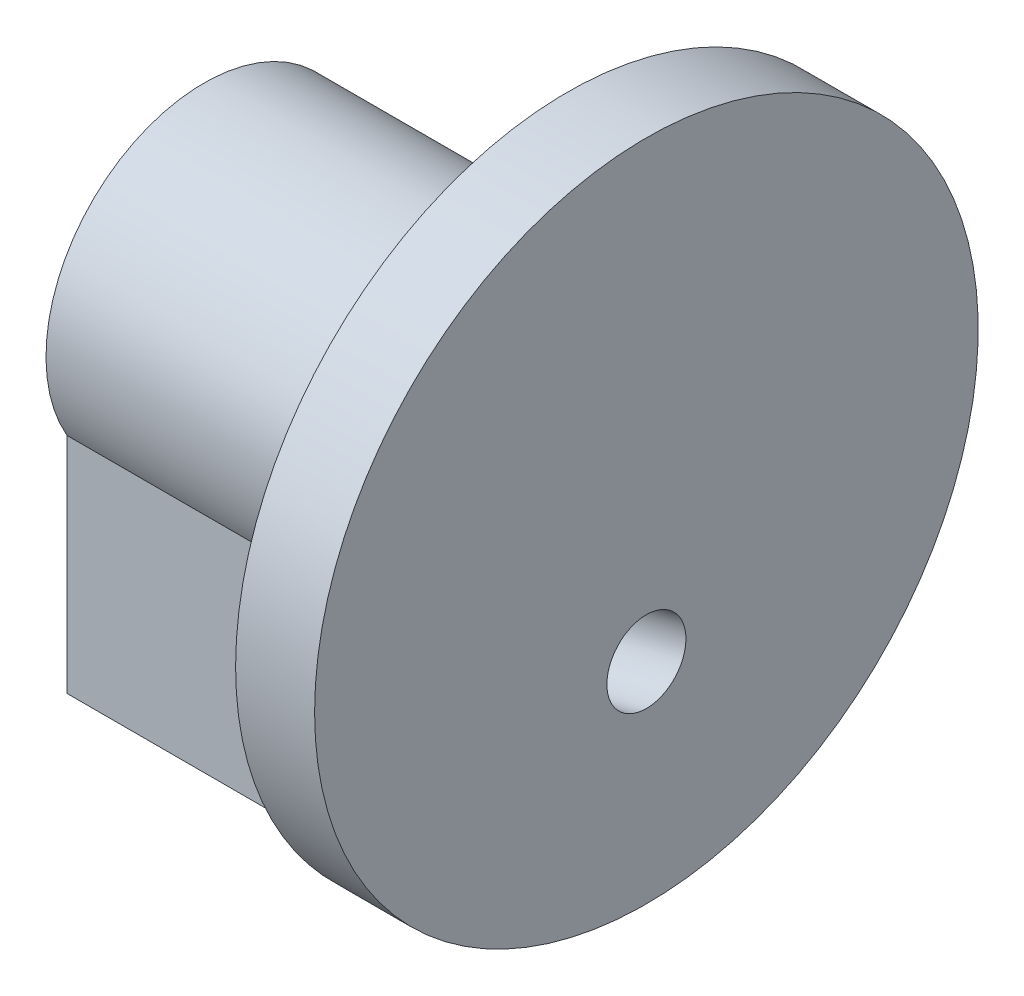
ISO-10303-21;
HEADER;
FILE_DESCRIPTION(('STEP AP214'),'2;1');
FILE_NAME('part.step','',(''),(''),'','','');
FILE_SCHEMA(('AUTOMOTIVE_DESIGN { 1 0 10303 214 1 1 1 1 }'));
ENDSEC;
DATA;
#1=APPLICATION_CONTEXT('core data for automotive mechanical design processes');
#2=APPLICATION_PROTOCOL_DEFINITION('international standard','automotive_design',2000,#1);
#3=PRODUCT_CONTEXT('',#1,'mechanical');
#4=PRODUCT('Part','Part','',(#3));
#5=PRODUCT_RELATED_PRODUCT_CATEGORY('part','',(#4));
#6=PRODUCT_DEFINITION_FORMATION('','',#4);
#7=PRODUCT_DEFINITION_CONTEXT('part definition',#1,'design');
#8=PRODUCT_DEFINITION('design','',#6,#7);
#9=PRODUCT_DEFINITION_SHAPE('','',#8);
#10=(LENGTH_UNIT() NAMED_UNIT(*) SI_UNIT(.MILLI.,.METRE.));
#11=(NAMED_UNIT(*) PLANE_ANGLE_UNIT() SI_UNIT($,.RADIAN.));
#12=(NAMED_UNIT(*) SI_UNIT($,.STERADIAN.) SOLID_ANGLE_UNIT());
#13=UNCERTAINTY_MEASURE_WITH_UNIT(LENGTH_MEASURE(1.E-05),#10,'distance_accuracy_value','');
#14=(GEOMETRIC_REPRESENTATION_CONTEXT(3) GLOBAL_UNCERTAINTY_ASSIGNED_CONTEXT((#13)) GLOBAL_UNIT_ASSIGNED_CONTEXT((#10,
#11,#12)) REPRESENTATION_CONTEXT('',''));
#15=CARTESIAN_POINT('',(0.,0.,0.));
#16=DIRECTION('',(0.,0.,1.));
#17=DIRECTION('',(1.,0.,0.));
#18=AXIS2_PLACEMENT_3D('',#15,#16,#17);
#19=CARTESIAN_POINT('',(0.,-4.2,0.));
#20=DIRECTION('',(1.,0.,0.));
#21=DIRECTION('',(0.,0.,-1.));
#22=AXIS2_PLACEMENT_3D('',#19,#20,#21);
#23=PLANE('',#22);
#24=CARTESIAN_POINT('',(0.,0.,0.));
#25=DIRECTION('',(-1.,0.,0.));
#26=DIRECTION('',(0.,0.,1.));
#27=AXIS2_PLACEMENT_3D('',#24,#25,#26);
#28=CIRCLE('',#27,4.2);
#29=CARTESIAN_POINT('',(0.,0.,4.2));
#30=VERTEX_POINT('',#29);
#31=EDGE_CURVE('E107',#30,#30,#28,.T.);
#32=ORIENTED_EDGE('',*,*,#31,.F.);
#33=EDGE_LOOP('',(#32));
#34=FACE_BOUND('',#33,.T.);
#35=CARTESIAN_POINT('',(0.,-1.54262279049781,0.));
#36=DIRECTION('',(1.,0.,0.));
#37=DIRECTION('',(0.,1.,0.));
#38=AXIS2_PLACEMENT_3D('',#35,#36,#37);
#39=ELLIPSE('',#38,0.514207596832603,0.5);
#40=CARTESIAN_POINT('',(0.,-1.02841519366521,0.));
#41=VERTEX_POINT('',#40);
#42=EDGE_CURVE('E33',#41,#41,#39,.F.);
#43=ORIENTED_EDGE('',*,*,#42,.T.);
#44=EDGE_LOOP('',(#43));
#45=FACE_BOUND('',#44,.T.);
#46=ADVANCED_FACE('F30',(#34,#45),#23,.T.);
#47=CARTESIAN_POINT('',(-1.5,0.,0.));
#48=DIRECTION('',(-1.,0.,0.));
#49=DIRECTION('',(0.,0.,1.));
#50=AXIS2_PLACEMENT_3D('',#47,#48,#49);
#51=CYLINDRICAL_SURFACE('',#50,4.2);
#52=DIRECTION('',(-1.,0.,0.));
#53=VECTOR('',#52,1.);
#54=CARTESIAN_POINT('',(-1.5,-3.82127880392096,-1.74293668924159));
#55=LINE('',#54,#53);
#56=CARTESIAN_POINT('',(-0.999999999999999,-3.82127880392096,-1.74293668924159));
#57=VERTEX_POINT('',#56);
#58=CARTESIAN_POINT('',(-5.6,-3.82127880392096,-1.74293668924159));
#59=VERTEX_POINT('',#58);
#60=EDGE_CURVE('E96',#57,#59,#55,.T.);
#61=ORIENTED_EDGE('',*,*,#60,.F.);
#62=CARTESIAN_POINT('',(-0.999999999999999,0.,0.));
#63=DIRECTION('',(1.,0.,0.));
#64=DIRECTION('',(0.,0.,-1.));
#65=AXIS2_PLACEMENT_3D('',#62,#63,#64);
#66=CIRCLE('',#65,4.2);
#67=CARTESIAN_POINT('',(-0.999999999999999,-3.82537386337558,1.73393044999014));
#68=VERTEX_POINT('',#67);
#69=EDGE_CURVE('E11',#68,#57,#66,.F.);
#70=ORIENTED_EDGE('',*,*,#69,.F.);
#71=DIRECTION('',(-1.,0.,0.));
#72=VECTOR('',#71,1.);
#73=CARTESIAN_POINT('',(-1.5,-3.82537386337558,1.73393044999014));
#74=LINE('',#73,#72);
#75=CARTESIAN_POINT('',(-5.6,-3.82537386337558,1.73393044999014));
#76=VERTEX_POINT('',#75);
#77=EDGE_CURVE('E82',#76,#68,#74,.F.);
#78=ORIENTED_EDGE('',*,*,#77,.F.);
#79=CARTESIAN_POINT('',(-5.6,0.,0.));
#80=DIRECTION('',(-1.,0.,0.));
#81=DIRECTION('',(0.,0.,1.));
#82=AXIS2_PLACEMENT_3D('',#79,#80,#81);
#83=CIRCLE('',#82,4.2);
#84=EDGE_CURVE('E104',#59,#76,#83,.T.);
#85=ORIENTED_EDGE('',*,*,#84,.F.);
#86=EDGE_LOOP('',(#61,#70,#78,#85));
#87=FACE_BOUND('',#86,.T.);
#88=ORIENTED_EDGE('',*,*,#31,.T.);
#89=EDGE_LOOP('',(#88));
#90=FACE_BOUND('',#89,.T.);
#91=ADVANCED_FACE('F119',(#87,#90),#51,.T.);
#92=CARTESIAN_POINT('',(-5.6,-4.2,0.));
#93=DIRECTION('',(-1.,0.,0.));
#94=DIRECTION('',(0.,0.,1.));
#95=AXIS2_PLACEMENT_3D('',#92,#93,#94);
#96=PLANE('',#95);
#97=DIRECTION('',(0.,1.,0.));
#98=VECTOR('',#97,1.);
#99=CARTESIAN_POINT('',(-5.6,-4.2,-1.74293668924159));
#100=LINE('',#99,#98);
#101=CARTESIAN_POINT('',(-5.6,-0.980903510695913,-1.74293668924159));
#102=VERTEX_POINT('',#101);
#103=EDGE_CURVE('E38',#59,#102,#100,.T.);
#104=ORIENTED_EDGE('',*,*,#103,.F.);
#105=ORIENTED_EDGE('',*,*,#84,.T.);
#106=DIRECTION('',(0.,-1.,0.));
#107=VECTOR('',#106,1.);
#108=CARTESIAN_POINT('',(-5.6,-4.64057941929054,1.73393044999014));
#109=LINE('',#108,#107);
#110=CARTESIAN_POINT('',(-5.6,-0.996737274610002,1.73393044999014));
#111=VERTEX_POINT('',#110);
#112=EDGE_CURVE('E86',#111,#76,#109,.T.);
#113=ORIENTED_EDGE('',*,*,#112,.F.);
#114=CARTESIAN_POINT('',(-5.6,0.,0.));
#115=DIRECTION('',(1.,0.,0.));
#116=DIRECTION('',(0.,0.,-1.));
#117=AXIS2_PLACEMENT_3D('',#114,#115,#116);
#118=CIRCLE('',#117,2.);
#119=EDGE_CURVE('E45',#102,#111,#118,.T.);
#120=ORIENTED_EDGE('',*,*,#119,.F.);
#121=EDGE_LOOP('',(#104,#105,#113,#120));
#122=FACE_BOUND('',#121,.T.);
#123=CARTESIAN_POINT('',(-5.6,0.,0.));
#124=DIRECTION('',(-1.,0.,0.));
#125=DIRECTION('',(0.,0.,1.));
#126=AXIS2_PLACEMENT_3D('',#123,#124,#125);
#127=CIRCLE('',#126,0.750000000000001);
#128=CARTESIAN_POINT('',(-5.6,0.,0.750000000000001));
#129=VERTEX_POINT('',#128);
#130=EDGE_CURVE('E101',#129,#129,#127,.T.);
#131=ORIENTED_EDGE('',*,*,#130,.F.);
#132=EDGE_LOOP('',(#131));
#133=FACE_BOUND('',#132,.T.);
#134=ADVANCED_FACE('F116',(#122,#133),#96,.T.);
#135=CARTESIAN_POINT('',(-1.5,0.,0.));
#136=DIRECTION('',(-1.,0.,0.));
#137=DIRECTION('',(0.,0.,1.));
#138=AXIS2_PLACEMENT_3D('',#135,#136,#137);
#139=CYLINDRICAL_SURFACE('',#138,0.750000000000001);
#140=ORIENTED_EDGE('',*,*,#130,.T.);
#141=EDGE_LOOP('',(#140));
#142=FACE_BOUND('',#141,.T.);
#143=CARTESIAN_POINT('',(-1.5,0.,0.));
#144=DIRECTION('',(-1.,0.,0.));
#145=DIRECTION('',(0.,0.,1.));
#146=AXIS2_PLACEMENT_3D('',#143,#144,#145);
#147=CIRCLE('',#146,0.750000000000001);
#148=CARTESIAN_POINT('',(-1.5,0.,0.750000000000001));
#149=VERTEX_POINT('',#148);
#150=EDGE_CURVE('E98',#149,#149,#147,.T.);
#151=ORIENTED_EDGE('',*,*,#150,.F.);
#152=EDGE_LOOP('',(#151));
#153=FACE_BOUND('',#152,.T.);
#154=ADVANCED_FACE('F153',(#142,#153),#139,.F.);
#155=CARTESIAN_POINT('',(-1.5,-0.750000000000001,0.));
#156=DIRECTION('',(-1.,0.,0.));
#157=DIRECTION('',(0.,0.,1.));
#158=AXIS2_PLACEMENT_3D('',#155,#156,#157);
#159=PLANE('',#158);
#160=ORIENTED_EDGE('',*,*,#150,.T.);
#161=EDGE_LOOP('',(#160));
#162=FACE_BOUND('',#161,.T.);
#163=ADVANCED_FACE('F150',(#162),#159,.T.);
#164=CARTESIAN_POINT('',(-0.999999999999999,0.,0.));
#165=DIRECTION('',(-1.,0.,0.));
#166=DIRECTION('',(0.,0.,1.));
#167=AXIS2_PLACEMENT_3D('',#164,#165,#166);
#168=CYLINDRICAL_SURFACE('',#167,2.);
#169=ORIENTED_EDGE('',*,*,#119,.T.);
#170=DIRECTION('',(-1.,0.,0.));
#171=VECTOR('',#170,1.);
#172=CARTESIAN_POINT('',(-0.999999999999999,-0.996737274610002,1.73393044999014));
#173=LINE('',#172,#171);
#174=CARTESIAN_POINT('',(-0.999999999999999,-0.996737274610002,1.73393044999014));
#175=VERTEX_POINT('',#174);
#176=EDGE_CURVE('E69',#175,#111,#173,.T.);
#177=ORIENTED_EDGE('',*,*,#176,.F.);
#178=CARTESIAN_POINT('',(-0.999999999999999,0.,0.));
#179=DIRECTION('',(1.,0.,0.));
#180=DIRECTION('',(0.,0.,-1.));
#181=AXIS2_PLACEMENT_3D('',#178,#179,#180);
#182=CIRCLE('',#181,2.);
#183=CARTESIAN_POINT('',(-0.999999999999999,-0.980903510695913,-1.74293668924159));
#184=VERTEX_POINT('',#183);
#185=EDGE_CURVE('E73',#184,#175,#182,.T.);
#186=ORIENTED_EDGE('',*,*,#185,.F.);
#187=DIRECTION('',(-1.,0.,0.));
#188=VECTOR('',#187,1.);
#189=CARTESIAN_POINT('',(-0.999999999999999,-0.980903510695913,-1.74293668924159));
#190=LINE('',#189,#188);
#191=EDGE_CURVE('E76',#184,#102,#190,.T.);
#192=ORIENTED_EDGE('',*,*,#191,.T.);
#193=EDGE_LOOP('',(#169,#177,#186,#192));
#194=FACE_BOUND('',#193,.T.);
#195=ADVANCED_FACE('F71',(#194),#168,.T.);
#196=CARTESIAN_POINT('',(-0.999999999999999,-0.980903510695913,-1.74293668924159));
#197=DIRECTION('',(0.,0.,1.));
#198=DIRECTION('',(1.,0.,0.));
#199=AXIS2_PLACEMENT_3D('',#196,#197,#198);
#200=PLANE('',#199);
#201=ORIENTED_EDGE('',*,*,#60,.T.);
#202=ORIENTED_EDGE('',*,*,#103,.T.);
#203=ORIENTED_EDGE('',*,*,#191,.F.);
#204=DIRECTION('',(0.,1.,0.));
#205=VECTOR('',#204,1.);
#206=CARTESIAN_POINT('',(-0.999999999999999,-0.980903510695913,-1.74293668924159));
#207=LINE('',#206,#205);
#208=EDGE_CURVE('E77',#57,#184,#207,.T.);
#209=ORIENTED_EDGE('',*,*,#208,.F.);
#210=EDGE_LOOP('',(#201,#202,#203,#209));
#211=FACE_BOUND('',#210,.T.);
#212=ADVANCED_FACE('F112',(#211),#200,.F.);
#213=CARTESIAN_POINT('',(-0.999999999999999,-4.64057941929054,1.73393044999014));
#214=DIRECTION('',(0.,0.,-1.));
#215=DIRECTION('',(-1.,0.,0.));
#216=AXIS2_PLACEMENT_3D('',#213,#214,#215);
#217=PLANE('',#216);
#218=ORIENTED_EDGE('',*,*,#77,.T.);
#219=DIRECTION('',(0.,-1.,0.));
#220=VECTOR('',#219,1.);
#221=CARTESIAN_POINT('',(-0.999999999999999,-4.64057941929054,1.73393044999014));
#222=LINE('',#221,#220);
#223=EDGE_CURVE('E79',#175,#68,#222,.T.);
#224=ORIENTED_EDGE('',*,*,#223,.F.);
#225=ORIENTED_EDGE('',*,*,#176,.T.);
#226=ORIENTED_EDGE('',*,*,#112,.T.);
#227=EDGE_LOOP('',(#218,#224,#225,#226));
#228=FACE_BOUND('',#227,.T.);
#229=ADVANCED_FACE('F80',(#228),#217,.F.);
#230=CARTESIAN_POINT('',(-0.999999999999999,0.,0.));
#231=DIRECTION('',(1.,0.,0.));
#232=DIRECTION('',(0.,0.,-1.));
#233=AXIS2_PLACEMENT_3D('',#230,#231,#232);
#234=PLANE('',#233);
#235=ORIENTED_EDGE('',*,*,#69,.T.);
#236=ORIENTED_EDGE('',*,*,#208,.T.);
#237=ORIENTED_EDGE('',*,*,#185,.T.);
#238=ORIENTED_EDGE('',*,*,#223,.T.);
#239=EDGE_LOOP('',(#235,#236,#237,#238));
#240=FACE_BOUND('',#239,.T.);
#241=ADVANCED_FACE('F84',(#240),#234,.F.);
#242=CARTESIAN_POINT('',(-4.60891854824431,-2.6491262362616,0.));
#243=DIRECTION('',(0.972369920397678,0.233445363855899,0.));
#244=DIRECTION('',(-0.233445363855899,0.972369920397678,0.));
#245=AXIS2_PLACEMENT_3D('',#242,#243,#244);
#246=CYLINDRICAL_SURFACE('',#245,0.5);
#247=ORIENTED_EDGE('',*,*,#42,.F.);
#248=EDGE_LOOP('',(#247));
#249=FACE_BOUND('',#248,.T.);
#250=CARTESIAN_POINT('',(-4.60891854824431,-2.6491262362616,0.));
#251=DIRECTION('',(-0.972369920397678,-0.233445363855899,0.));
#252=DIRECTION('',(0.233445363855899,-0.972369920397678,0.));
#253=AXIS2_PLACEMENT_3D('',#250,#251,#252);
#254=CIRCLE('',#253,0.5);
#255=CARTESIAN_POINT('',(-4.49219586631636,-3.13531119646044,0.));
#256=VERTEX_POINT('',#255);
#257=EDGE_CURVE('E90',#256,#256,#254,.T.);
#258=ORIENTED_EDGE('',*,*,#257,.T.);
#259=EDGE_LOOP('',(#258));
#260=FACE_BOUND('',#259,.T.);
#261=ADVANCED_FACE('F132',(#249,#260),#246,.F.);
#262=CARTESIAN_POINT('',(-4.60891854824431,-2.6491262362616,0.));
#263=DIRECTION('',(-0.972369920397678,-0.233445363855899,0.));
#264=DIRECTION('',(0.233445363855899,-0.972369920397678,0.));
#265=AXIS2_PLACEMENT_3D('',#262,#263,#264);
#266=PLANE('',#265);
#267=ORIENTED_EDGE('',*,*,#257,.F.);
#268=EDGE_LOOP('',(#267));
#269=FACE_BOUND('',#268,.T.);
#270=ADVANCED_FACE('F134',(#269),#266,.F.);
#271=CLOSED_SHELL('',(#46,#91,#134,#154,#163,#195,#212,#229,#241,#261,#270));
#272=MANIFOLD_SOLID_BREP('B2',#271);
#273=ADVANCED_BREP_SHAPE_REPRESENTATION('',(#18,#272),#14);
#274=SHAPE_DEFINITION_REPRESENTATION(#9,#273);
ENDSEC;
END-ISO-10303-21;
